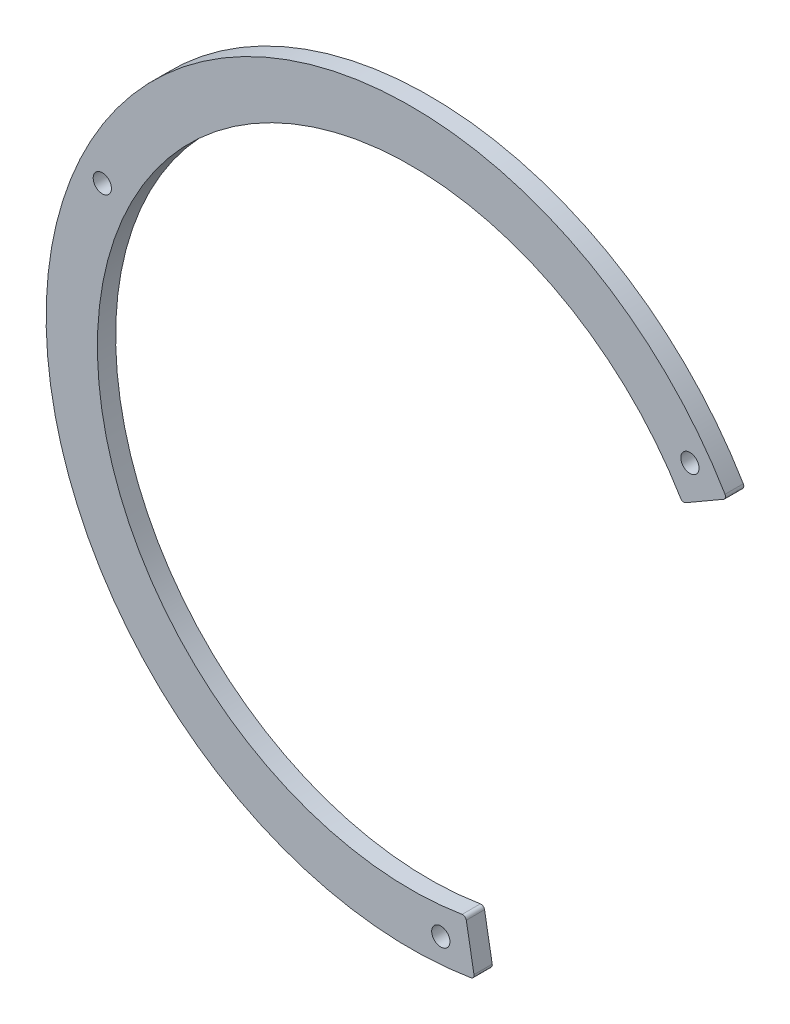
from build123d import *

# Parameters (mm, degrees)
CROQUIS1_R              = 2.5
SALIENTE_EXTRUIR1_DEPTH = 5
REDONDEO1_R             = 1


with BuildPart() as part:
    # Croquis1 → Saliente-Extruir1 (new body)
    with BuildSketch(Plane.XY):
        with BuildLine():
            Line((14.983683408, -84.634590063), (17.432879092, -98.46875))
            ThreePointArc((17.432879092, -98.46875), (-90.659966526, 42.199176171), (86.567961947, 50.05984383))
            Line((86.567961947, 50.05984383), (74.405778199, 43.026791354))
            ThreePointArc((74.405778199, 43.026791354), (-77.9228852, 36.270491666), (14.983683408, -84.634590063))
        make_face()
        with Locations((76.435686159, 53.560218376)):
            Circle(CROQUIS1_R, mode=Mode.SUBTRACT)
        with Locations((8.166666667, -92.975355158)):
            Circle(CROQUIS1_R, mode=Mode.SUBTRACT)
        with Locations((-84.602352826, 39.415136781)):
            Circle(CROQUIS1_R, mode=Mode.SUBTRACT)
    extrude(amount=SALIENTE_EXTRUIR1_DEPTH)

    # Redondeo1
    redondeo1_edges = [part.edges().sort_by_distance(p)[0] for p in [
        (86.567961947, 50.05984383, 2.5),
        (74.405778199, 43.026791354, 2.5),
        (14.983683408, -84.634590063, 2.5),
        (17.432879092, -98.46875, 2.5),
    ]]
    fillet(redondeo1_edges, radius=REDONDEO1_R)


solid = part.part
